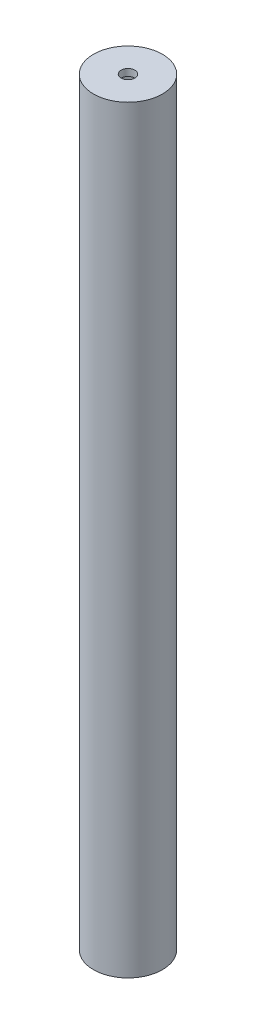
ISO-10303-21;
HEADER;
FILE_DESCRIPTION(('STEP AP214'),'2;1');
FILE_NAME('part.step','',(''),(''),'','','');
FILE_SCHEMA(('AUTOMOTIVE_DESIGN { 1 0 10303 214 1 1 1 1 }'));
ENDSEC;
DATA;
#1=APPLICATION_CONTEXT('core data for automotive mechanical design processes');
#2=APPLICATION_PROTOCOL_DEFINITION('international standard','automotive_design',2000,#1);
#3=PRODUCT_CONTEXT('',#1,'mechanical');
#4=PRODUCT('Part','Part','',(#3));
#5=PRODUCT_RELATED_PRODUCT_CATEGORY('part','',(#4));
#6=PRODUCT_DEFINITION_FORMATION('','',#4);
#7=PRODUCT_DEFINITION_CONTEXT('part definition',#1,'design');
#8=PRODUCT_DEFINITION('design','',#6,#7);
#9=PRODUCT_DEFINITION_SHAPE('','',#8);
#10=(LENGTH_UNIT() NAMED_UNIT(*) SI_UNIT(.MILLI.,.METRE.));
#11=(NAMED_UNIT(*) PLANE_ANGLE_UNIT() SI_UNIT($,.RADIAN.));
#12=(NAMED_UNIT(*) SI_UNIT($,.STERADIAN.) SOLID_ANGLE_UNIT());
#13=UNCERTAINTY_MEASURE_WITH_UNIT(LENGTH_MEASURE(1.E-05),#10,'distance_accuracy_value','');
#14=(GEOMETRIC_REPRESENTATION_CONTEXT(3) GLOBAL_UNCERTAINTY_ASSIGNED_CONTEXT((#13)) GLOBAL_UNIT_ASSIGNED_CONTEXT((#10,
#11,#12)) REPRESENTATION_CONTEXT('',''));
#15=CARTESIAN_POINT('',(0.,0.,0.));
#16=DIRECTION('',(0.,0.,1.));
#17=DIRECTION('',(1.,0.,0.));
#18=AXIS2_PLACEMENT_3D('',#15,#16,#17);
#19=CARTESIAN_POINT('',(-41.2667857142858,300.492142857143,0.));
#20=DIRECTION('',(0.,1.,0.));
#21=DIRECTION('',(-1.,0.,0.));
#22=AXIS2_PLACEMENT_3D('',#19,#20,#21);
#23=CYLINDRICAL_SURFACE('',#22,25.);
#24=CARTESIAN_POINT('',(-41.2667857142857,-194.507857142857,0.));
#25=DIRECTION('',(0.,1.,0.));
#26=DIRECTION('',(-1.,0.,0.));
#27=AXIS2_PLACEMENT_3D('',#24,#25,#26);
#28=CIRCLE('',#27,25.);
#29=CARTESIAN_POINT('',(-66.2667857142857,-194.507857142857,0.));
#30=VERTEX_POINT('',#29);
#31=EDGE_CURVE('E10',#30,#30,#28,.T.);
#32=ORIENTED_EDGE('',*,*,#31,.T.);
#33=EDGE_LOOP('',(#32));
#34=FACE_BOUND('',#33,.T.);
#35=CARTESIAN_POINT('',(-41.2667857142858,355.492142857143,0.));
#36=DIRECTION('',(0.,1.,0.));
#37=DIRECTION('',(-1.,0.,0.));
#38=AXIS2_PLACEMENT_3D('',#35,#36,#37);
#39=CIRCLE('',#38,25.);
#40=CARTESIAN_POINT('',(-66.2667857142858,355.492142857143,0.));
#41=VERTEX_POINT('',#40);
#42=EDGE_CURVE('E55',#41,#41,#39,.T.);
#43=ORIENTED_EDGE('',*,*,#42,.F.);
#44=EDGE_LOOP('',(#43));
#45=FACE_BOUND('',#44,.T.);
#46=ADVANCED_FACE('F27',(#34,#45),#23,.T.);
#47=CARTESIAN_POINT('',(-66.2667857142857,-194.507857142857,0.));
#48=DIRECTION('',(0.,-1.,0.));
#49=DIRECTION('',(1.,0.,0.));
#50=AXIS2_PLACEMENT_3D('',#47,#48,#49);
#51=PLANE('',#50);
#52=CARTESIAN_POINT('',(-41.2667857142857,-194.507857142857,0.));
#53=DIRECTION('',(0.,1.,0.));
#54=DIRECTION('',(-1.,0.,0.));
#55=AXIS2_PLACEMENT_3D('',#52,#53,#54);
#56=CIRCLE('',#55,10.);
#57=CARTESIAN_POINT('',(-51.2667857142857,-194.507857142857,0.));
#58=VERTEX_POINT('',#57);
#59=EDGE_CURVE('E33',#58,#58,#56,.T.);
#60=ORIENTED_EDGE('',*,*,#59,.T.);
#61=EDGE_LOOP('',(#60));
#62=FACE_BOUND('',#61,.T.);
#63=ORIENTED_EDGE('',*,*,#31,.F.);
#64=EDGE_LOOP('',(#63));
#65=FACE_BOUND('',#64,.T.);
#66=ADVANCED_FACE('F63',(#62,#65),#51,.T.);
#67=CARTESIAN_POINT('',(-41.2667857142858,300.492142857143,0.));
#68=DIRECTION('',(0.,1.,0.));
#69=DIRECTION('',(-1.,0.,0.));
#70=AXIS2_PLACEMENT_3D('',#67,#68,#69);
#71=CYLINDRICAL_SURFACE('',#70,10.);
#72=CARTESIAN_POINT('',(-41.2667857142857,-189.507857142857,0.));
#73=DIRECTION('',(0.,1.,0.));
#74=DIRECTION('',(-1.,0.,0.));
#75=AXIS2_PLACEMENT_3D('',#72,#73,#74);
#76=CIRCLE('',#75,10.);
#77=CARTESIAN_POINT('',(-51.2667857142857,-189.507857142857,0.));
#78=VERTEX_POINT('',#77);
#79=EDGE_CURVE('E37',#78,#78,#76,.T.);
#80=ORIENTED_EDGE('',*,*,#79,.T.);
#81=EDGE_LOOP('',(#80));
#82=FACE_BOUND('',#81,.T.);
#83=ORIENTED_EDGE('',*,*,#59,.F.);
#84=EDGE_LOOP('',(#83));
#85=FACE_BOUND('',#84,.T.);
#86=ADVANCED_FACE('F67',(#82,#85),#71,.F.);
#87=CARTESIAN_POINT('',(-61.2667857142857,-189.507857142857,0.));
#88=DIRECTION('',(0.,1.,0.));
#89=DIRECTION('',(-1.,0.,0.));
#90=AXIS2_PLACEMENT_3D('',#87,#88,#89);
#91=PLANE('',#90);
#92=CARTESIAN_POINT('',(-41.2667857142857,-189.507857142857,0.));
#93=DIRECTION('',(0.,1.,0.));
#94=DIRECTION('',(-1.,0.,0.));
#95=AXIS2_PLACEMENT_3D('',#92,#93,#94);
#96=CIRCLE('',#95,20.);
#97=CARTESIAN_POINT('',(-61.2667857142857,-189.507857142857,0.));
#98=VERTEX_POINT('',#97);
#99=EDGE_CURVE('E41',#98,#98,#96,.T.);
#100=ORIENTED_EDGE('',*,*,#99,.T.);
#101=EDGE_LOOP('',(#100));
#102=FACE_BOUND('',#101,.T.);
#103=ORIENTED_EDGE('',*,*,#79,.F.);
#104=EDGE_LOOP('',(#103));
#105=FACE_BOUND('',#104,.T.);
#106=ADVANCED_FACE('F71',(#102,#105),#91,.T.);
#107=CARTESIAN_POINT('',(-41.2667857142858,300.492142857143,0.));
#108=DIRECTION('',(0.,1.,0.));
#109=DIRECTION('',(-1.,0.,0.));
#110=AXIS2_PLACEMENT_3D('',#107,#108,#109);
#111=CYLINDRICAL_SURFACE('',#110,20.);
#112=CARTESIAN_POINT('',(-41.2667857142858,350.492142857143,0.));
#113=DIRECTION('',(0.,1.,0.));
#114=DIRECTION('',(-1.,0.,0.));
#115=AXIS2_PLACEMENT_3D('',#112,#113,#114);
#116=CIRCLE('',#115,20.);
#117=CARTESIAN_POINT('',(-61.2667857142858,350.492142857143,0.));
#118=VERTEX_POINT('',#117);
#119=EDGE_CURVE('E46',#118,#118,#116,.T.);
#120=ORIENTED_EDGE('',*,*,#119,.T.);
#121=EDGE_LOOP('',(#120));
#122=FACE_BOUND('',#121,.T.);
#123=ORIENTED_EDGE('',*,*,#99,.F.);
#124=EDGE_LOOP('',(#123));
#125=FACE_BOUND('',#124,.T.);
#126=ADVANCED_FACE('F78',(#122,#125),#111,.F.);
#127=CARTESIAN_POINT('',(-46.2651813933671,350.492142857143,0.));
#128=DIRECTION('',(0.,-1.,0.));
#129=DIRECTION('',(1.,0.,0.));
#130=AXIS2_PLACEMENT_3D('',#127,#128,#129);
#131=PLANE('',#130);
#132=CARTESIAN_POINT('',(-41.2667857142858,350.492142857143,0.));
#133=DIRECTION('',(0.,1.,0.));
#134=DIRECTION('',(-1.,0.,0.));
#135=AXIS2_PLACEMENT_3D('',#132,#133,#134);
#136=CIRCLE('',#135,4.99839567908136);
#137=CARTESIAN_POINT('',(-46.2651813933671,350.492142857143,0.));
#138=VERTEX_POINT('',#137);
#139=EDGE_CURVE('E49',#138,#138,#136,.T.);
#140=ORIENTED_EDGE('',*,*,#139,.T.);
#141=EDGE_LOOP('',(#140));
#142=FACE_BOUND('',#141,.T.);
#143=ORIENTED_EDGE('',*,*,#119,.F.);
#144=EDGE_LOOP('',(#143));
#145=FACE_BOUND('',#144,.T.);
#146=ADVANCED_FACE('F82',(#142,#145),#131,.T.);
#147=CARTESIAN_POINT('',(-41.2667857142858,350.492142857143,0.));
#148=DIRECTION('',(0.,1.,0.));
#149=DIRECTION('',(-1.,0.,0.));
#150=AXIS2_PLACEMENT_3D('',#147,#148,#149);
#151=CONICAL_SURFACE('',#150,4.99839567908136,0.000320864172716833);
#152=CARTESIAN_POINT('',(-41.2667857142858,355.492142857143,0.));
#153=DIRECTION('',(0.,1.,0.));
#154=DIRECTION('',(-1.,0.,0.));
#155=AXIS2_PLACEMENT_3D('',#152,#153,#154);
#156=CIRCLE('',#155,5.);
#157=CARTESIAN_POINT('',(-46.2667857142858,355.492142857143,0.));
#158=VERTEX_POINT('',#157);
#159=EDGE_CURVE('E52',#158,#158,#156,.T.);
#160=ORIENTED_EDGE('',*,*,#159,.T.);
#161=EDGE_LOOP('',(#160));
#162=FACE_BOUND('',#161,.T.);
#163=ORIENTED_EDGE('',*,*,#139,.F.);
#164=EDGE_LOOP('',(#163));
#165=FACE_BOUND('',#164,.T.);
#166=ADVANCED_FACE('F86',(#162,#165),#151,.F.);
#167=CARTESIAN_POINT('',(-51.2667857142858,355.492142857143,0.));
#168=DIRECTION('',(0.,1.,0.));
#169=DIRECTION('',(-1.,0.,0.));
#170=AXIS2_PLACEMENT_3D('',#167,#168,#169);
#171=PLANE('',#170);
#172=ORIENTED_EDGE('',*,*,#42,.T.);
#173=EDGE_LOOP('',(#172));
#174=FACE_BOUND('',#173,.T.);
#175=ORIENTED_EDGE('',*,*,#159,.F.);
#176=EDGE_LOOP('',(#175));
#177=FACE_BOUND('',#176,.T.);
#178=ADVANCED_FACE('F59',(#174,#177),#171,.T.);
#179=CLOSED_SHELL('',(#46,#66,#86,#106,#126,#146,#166,#178));
#180=MANIFOLD_SOLID_BREP('B2',#179);
#181=ADVANCED_BREP_SHAPE_REPRESENTATION('',(#18,#180),#14);
#182=SHAPE_DEFINITION_REPRESENTATION(#9,#181);
ENDSEC;
END-ISO-10303-21;
